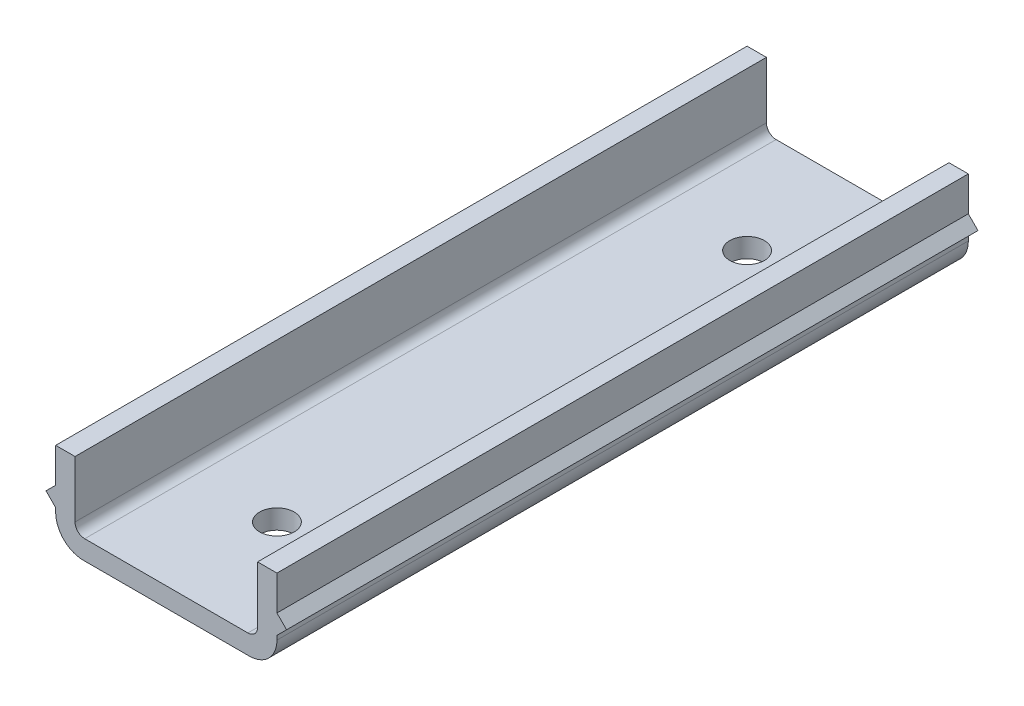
ISO-10303-21;
HEADER;
FILE_DESCRIPTION(('STEP AP214'),'2;1');
FILE_NAME('part.step','',(''),(''),'','','');
FILE_SCHEMA(('AUTOMOTIVE_DESIGN { 1 0 10303 214 1 1 1 1 }'));
ENDSEC;
DATA;
#1=APPLICATION_CONTEXT('core data for automotive mechanical design processes');
#2=APPLICATION_PROTOCOL_DEFINITION('international standard','automotive_design',2000,#1);
#3=PRODUCT_CONTEXT('',#1,'mechanical');
#4=PRODUCT('Part','Part','',(#3));
#5=PRODUCT_RELATED_PRODUCT_CATEGORY('part','',(#4));
#6=PRODUCT_DEFINITION_FORMATION('','',#4);
#7=PRODUCT_DEFINITION_CONTEXT('part definition',#1,'design');
#8=PRODUCT_DEFINITION('design','',#6,#7);
#9=PRODUCT_DEFINITION_SHAPE('','',#8);
#10=(LENGTH_UNIT() NAMED_UNIT(*) SI_UNIT(.MILLI.,.METRE.));
#11=(NAMED_UNIT(*) PLANE_ANGLE_UNIT() SI_UNIT($,.RADIAN.));
#12=(NAMED_UNIT(*) SI_UNIT($,.STERADIAN.) SOLID_ANGLE_UNIT());
#13=UNCERTAINTY_MEASURE_WITH_UNIT(LENGTH_MEASURE(1.E-05),#10,'distance_accuracy_value','');
#14=(GEOMETRIC_REPRESENTATION_CONTEXT(3) GLOBAL_UNCERTAINTY_ASSIGNED_CONTEXT((#13)) GLOBAL_UNIT_ASSIGNED_CONTEXT((#10,
#11,#12)) REPRESENTATION_CONTEXT('',''));
#15=CARTESIAN_POINT('',(0.,0.,0.));
#16=DIRECTION('',(0.,0.,1.));
#17=DIRECTION('',(1.,0.,0.));
#18=AXIS2_PLACEMENT_3D('',#15,#16,#17);
#19=CARTESIAN_POINT('',(8.00000000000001,2.3,50.));
#20=DIRECTION('',(-1.,0.,0.));
#21=DIRECTION('',(0.,-1.,0.));
#22=AXIS2_PLACEMENT_3D('',#19,#20,#21);
#23=PLANE('',#22);
#24=DIRECTION('',(0.,1.,0.));
#25=VECTOR('',#24,1.);
#26=CARTESIAN_POINT('',(8.00000000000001,2.3,50.));
#27=LINE('',#26,#25);
#28=CARTESIAN_POINT('',(8.00000000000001,2.,50.));
#29=VERTEX_POINT('',#28);
#30=CARTESIAN_POINT('',(8.00000000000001,2.3,50.));
#31=VERTEX_POINT('',#30);
#32=EDGE_CURVE('E230',#29,#31,#27,.T.);
#33=ORIENTED_EDGE('',*,*,#32,.F.);
#34=DIRECTION('',(0.,0.,-1.));
#35=VECTOR('',#34,1.);
#36=CARTESIAN_POINT('',(8.00000000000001,2.,50.));
#37=LINE('',#36,#35);
#38=CARTESIAN_POINT('',(8.,2.,0.));
#39=VERTEX_POINT('',#38);
#40=EDGE_CURVE('E262',#29,#39,#37,.T.);
#41=ORIENTED_EDGE('',*,*,#40,.T.);
#42=DIRECTION('',(0.,1.,0.));
#43=VECTOR('',#42,1.);
#44=CARTESIAN_POINT('',(8.,2.3,0.));
#45=LINE('',#44,#43);
#46=CARTESIAN_POINT('',(8.,2.3,0.));
#47=VERTEX_POINT('',#46);
#48=EDGE_CURVE('E168',#39,#47,#45,.T.);
#49=ORIENTED_EDGE('',*,*,#48,.T.);
#50=DIRECTION('',(0.,0.,-1.));
#51=VECTOR('',#50,1.);
#52=CARTESIAN_POINT('',(8.00000000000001,2.3,50.));
#53=LINE('',#52,#51);
#54=EDGE_CURVE('E259',#31,#47,#53,.T.);
#55=ORIENTED_EDGE('',*,*,#54,.F.);
#56=EDGE_LOOP('',(#33,#41,#49,#55));
#57=FACE_BOUND('',#56,.T.);
#58=ADVANCED_FACE('F33',(#57),#23,.F.);
#59=CARTESIAN_POINT('',(8.7,2.99999999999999,50.));
#60=DIRECTION('',(-0.707106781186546,0.70710678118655,0.));
#61=DIRECTION('',(-0.707106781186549,-0.707106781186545,0.));
#62=AXIS2_PLACEMENT_3D('',#59,#60,#61);
#63=PLANE('',#62);
#64=DIRECTION('',(0.707106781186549,0.707106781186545,0.));
#65=VECTOR('',#64,1.);
#66=CARTESIAN_POINT('',(8.7,3.,0.));
#67=LINE('',#66,#65);
#68=CARTESIAN_POINT('',(8.7,3.,0.));
#69=VERTEX_POINT('',#68);
#70=EDGE_CURVE('E215',#47,#69,#67,.T.);
#71=ORIENTED_EDGE('',*,*,#70,.T.);
#72=DIRECTION('',(0.,0.,-1.));
#73=VECTOR('',#72,1.);
#74=CARTESIAN_POINT('',(8.7,2.99999999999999,50.));
#75=LINE('',#74,#73);
#76=CARTESIAN_POINT('',(8.7,2.99999999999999,50.));
#77=VERTEX_POINT('',#76);
#78=EDGE_CURVE('E256',#77,#69,#75,.T.);
#79=ORIENTED_EDGE('',*,*,#78,.F.);
#80=DIRECTION('',(0.707106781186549,0.707106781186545,0.));
#81=VECTOR('',#80,1.);
#82=CARTESIAN_POINT('',(8.7,2.99999999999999,50.));
#83=LINE('',#82,#81);
#84=EDGE_CURVE('E232',#31,#77,#83,.T.);
#85=ORIENTED_EDGE('',*,*,#84,.F.);
#86=ORIENTED_EDGE('',*,*,#54,.T.);
#87=EDGE_LOOP('',(#71,#79,#85,#86));
#88=FACE_BOUND('',#87,.T.);
#89=ADVANCED_FACE('F370',(#88),#63,.F.);
#90=CARTESIAN_POINT('',(8.00000000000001,3.69999999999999,50.));
#91=DIRECTION('',(-0.707106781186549,-0.707106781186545,0.));
#92=DIRECTION('',(0.707106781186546,-0.70710678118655,0.));
#93=AXIS2_PLACEMENT_3D('',#90,#91,#92);
#94=PLANE('',#93);
#95=DIRECTION('',(-0.707106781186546,0.70710678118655,0.));
#96=VECTOR('',#95,1.);
#97=CARTESIAN_POINT('',(8.,3.7,0.));
#98=LINE('',#97,#96);
#99=CARTESIAN_POINT('',(8.,3.7,0.));
#100=VERTEX_POINT('',#99);
#101=EDGE_CURVE('E217',#69,#100,#98,.T.);
#102=ORIENTED_EDGE('',*,*,#101,.T.);
#103=DIRECTION('',(0.,0.,-1.));
#104=VECTOR('',#103,1.);
#105=CARTESIAN_POINT('',(8.00000000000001,3.69999999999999,50.));
#106=LINE('',#105,#104);
#107=CARTESIAN_POINT('',(8.00000000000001,3.69999999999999,50.));
#108=VERTEX_POINT('',#107);
#109=EDGE_CURVE('E253',#108,#100,#106,.T.);
#110=ORIENTED_EDGE('',*,*,#109,.F.);
#111=DIRECTION('',(-0.707106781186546,0.70710678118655,0.));
#112=VECTOR('',#111,1.);
#113=CARTESIAN_POINT('',(8.00000000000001,3.69999999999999,50.));
#114=LINE('',#113,#112);
#115=EDGE_CURVE('E234',#77,#108,#114,.T.);
#116=ORIENTED_EDGE('',*,*,#115,.F.);
#117=ORIENTED_EDGE('',*,*,#78,.T.);
#118=EDGE_LOOP('',(#102,#110,#116,#117));
#119=FACE_BOUND('',#118,.T.);
#120=ADVANCED_FACE('F366',(#119),#94,.F.);
#121=CARTESIAN_POINT('',(8.,6.19999999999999,50.));
#122=DIRECTION('',(-1.,0.,0.));
#123=DIRECTION('',(0.,-1.,0.));
#124=AXIS2_PLACEMENT_3D('',#121,#122,#123);
#125=PLANE('',#124);
#126=DIRECTION('',(0.,1.,0.));
#127=VECTOR('',#126,1.);
#128=CARTESIAN_POINT('',(8.,6.2,0.));
#129=LINE('',#128,#127);
#130=CARTESIAN_POINT('',(8.,6.2,0.));
#131=VERTEX_POINT('',#130);
#132=EDGE_CURVE('E219',#100,#131,#129,.T.);
#133=ORIENTED_EDGE('',*,*,#132,.T.);
#134=DIRECTION('',(0.,0.,-1.));
#135=VECTOR('',#134,1.);
#136=CARTESIAN_POINT('',(8.,6.19999999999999,50.));
#137=LINE('',#136,#135);
#138=CARTESIAN_POINT('',(8.,6.19999999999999,50.));
#139=VERTEX_POINT('',#138);
#140=EDGE_CURVE('E250',#139,#131,#137,.T.);
#141=ORIENTED_EDGE('',*,*,#140,.F.);
#142=DIRECTION('',(0.,1.,0.));
#143=VECTOR('',#142,1.);
#144=CARTESIAN_POINT('',(8.,6.19999999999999,50.));
#145=LINE('',#144,#143);
#146=EDGE_CURVE('E236',#108,#139,#145,.T.);
#147=ORIENTED_EDGE('',*,*,#146,.F.);
#148=ORIENTED_EDGE('',*,*,#109,.T.);
#149=EDGE_LOOP('',(#133,#141,#147,#148));
#150=FACE_BOUND('',#149,.T.);
#151=ADVANCED_FACE('F361',(#150),#125,.F.);
#152=CARTESIAN_POINT('',(6.6,6.19999999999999,50.));
#153=DIRECTION('',(0.,-1.,0.));
#154=DIRECTION('',(1.,0.,0.));
#155=AXIS2_PLACEMENT_3D('',#152,#153,#154);
#156=PLANE('',#155);
#157=DIRECTION('',(-1.,0.,0.));
#158=VECTOR('',#157,1.);
#159=CARTESIAN_POINT('',(6.6,6.2,0.));
#160=LINE('',#159,#158);
#161=CARTESIAN_POINT('',(6.6,6.2,0.));
#162=VERTEX_POINT('',#161);
#163=EDGE_CURVE('E221',#131,#162,#160,.T.);
#164=ORIENTED_EDGE('',*,*,#163,.T.);
#165=DIRECTION('',(0.,0.,-1.));
#166=VECTOR('',#165,1.);
#167=CARTESIAN_POINT('',(6.6,6.19999999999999,50.));
#168=LINE('',#167,#166);
#169=CARTESIAN_POINT('',(6.6,6.19999999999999,50.));
#170=VERTEX_POINT('',#169);
#171=EDGE_CURVE('E247',#170,#162,#168,.T.);
#172=ORIENTED_EDGE('',*,*,#171,.F.);
#173=DIRECTION('',(-1.,0.,0.));
#174=VECTOR('',#173,1.);
#175=CARTESIAN_POINT('',(6.6,6.19999999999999,50.));
#176=LINE('',#175,#174);
#177=EDGE_CURVE('E238',#139,#170,#176,.T.);
#178=ORIENTED_EDGE('',*,*,#177,.F.);
#179=ORIENTED_EDGE('',*,*,#140,.T.);
#180=EDGE_LOOP('',(#164,#172,#178,#179));
#181=FACE_BOUND('',#180,.T.);
#182=ADVANCED_FACE('F355',(#181),#156,.F.);
#183=CARTESIAN_POINT('',(6.6,6.19999999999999,50.));
#184=DIRECTION('',(1.,0.,0.));
#185=DIRECTION('',(0.,1.,0.));
#186=AXIS2_PLACEMENT_3D('',#183,#184,#185);
#187=PLANE('',#186);
#188=DIRECTION('',(0.,-1.,0.));
#189=VECTOR('',#188,1.);
#190=CARTESIAN_POINT('',(6.6,6.2,0.));
#191=LINE('',#190,#189);
#192=CARTESIAN_POINT('',(6.6,2.1,0.));
#193=VERTEX_POINT('',#192);
#194=EDGE_CURVE('E223',#162,#193,#191,.T.);
#195=ORIENTED_EDGE('',*,*,#194,.T.);
#196=DIRECTION('',(0.,0.,-1.));
#197=VECTOR('',#196,1.);
#198=CARTESIAN_POINT('',(6.60000000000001,2.09999999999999,50.));
#199=LINE('',#198,#197);
#200=CARTESIAN_POINT('',(6.60000000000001,2.1,50.));
#201=VERTEX_POINT('',#200);
#202=EDGE_CURVE('E276',#193,#201,#199,.F.);
#203=ORIENTED_EDGE('',*,*,#202,.T.);
#204=DIRECTION('',(0.,-1.,0.));
#205=VECTOR('',#204,1.);
#206=CARTESIAN_POINT('',(6.6,6.19999999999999,50.));
#207=LINE('',#206,#205);
#208=EDGE_CURVE('E240',#170,#201,#207,.T.);
#209=ORIENTED_EDGE('',*,*,#208,.F.);
#210=ORIENTED_EDGE('',*,*,#171,.T.);
#211=EDGE_LOOP('',(#195,#203,#209,#210));
#212=FACE_BOUND('',#211,.T.);
#213=ADVANCED_FACE('F337',(#212),#187,.F.);
#214=CARTESIAN_POINT('',(6.60000000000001,1.39999999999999,50.));
#215=DIRECTION('',(0.,-1.,0.));
#216=DIRECTION('',(1.,0.,0.));
#217=AXIS2_PLACEMENT_3D('',#214,#215,#216);
#218=PLANE('',#217);
#219=CARTESIAN_POINT('',(0.,1.4,42.));
#220=DIRECTION('',(0.,-1.,0.));
#221=DIRECTION('',(1.,0.,0.));
#222=AXIS2_PLACEMENT_3D('',#219,#220,#221);
#223=CIRCLE('',#222,1.24999999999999);
#224=CARTESIAN_POINT('',(1.25,1.4,42.));
#225=VERTEX_POINT('',#224);
#226=EDGE_CURVE('E318',#225,#225,#223,.T.);
#227=ORIENTED_EDGE('',*,*,#226,.T.);
#228=EDGE_LOOP('',(#227));
#229=FACE_BOUND('',#228,.T.);
#230=CARTESIAN_POINT('',(0.,1.4,8.));
#231=DIRECTION('',(0.,-1.,0.));
#232=DIRECTION('',(1.,0.,0.));
#233=AXIS2_PLACEMENT_3D('',#230,#231,#232);
#234=CIRCLE('',#233,1.24999999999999);
#235=CARTESIAN_POINT('',(1.25,1.4,8.));
#236=VERTEX_POINT('',#235);
#237=EDGE_CURVE('E311',#236,#236,#234,.T.);
#238=ORIENTED_EDGE('',*,*,#237,.T.);
#239=EDGE_LOOP('',(#238));
#240=FACE_BOUND('',#239,.T.);
#241=DIRECTION('',(-1.,0.,0.));
#242=VECTOR('',#241,1.);
#243=CARTESIAN_POINT('',(6.6,1.4,0.));
#244=LINE('',#243,#242);
#245=CARTESIAN_POINT('',(5.9,1.4,0.));
#246=VERTEX_POINT('',#245);
#247=CARTESIAN_POINT('',(-5.9,1.4,0.));
#248=VERTEX_POINT('',#247);
#249=EDGE_CURVE('E226',#246,#248,#244,.T.);
#250=ORIENTED_EDGE('',*,*,#249,.T.);
#251=DIRECTION('',(0.,0.,-1.));
#252=VECTOR('',#251,1.);
#253=CARTESIAN_POINT('',(-5.9,1.4,50.));
#254=LINE('',#253,#252);
#255=CARTESIAN_POINT('',(-5.9,1.4,50.));
#256=VERTEX_POINT('',#255);
#257=EDGE_CURVE('E53',#248,#256,#254,.F.);
#258=ORIENTED_EDGE('',*,*,#257,.T.);
#259=DIRECTION('',(-1.,0.,0.));
#260=VECTOR('',#259,1.);
#261=CARTESIAN_POINT('',(6.60000000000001,1.39999999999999,50.));
#262=LINE('',#261,#260);
#263=CARTESIAN_POINT('',(5.90000000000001,1.39999999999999,50.));
#264=VERTEX_POINT('',#263);
#265=EDGE_CURVE('E243',#264,#256,#262,.T.);
#266=ORIENTED_EDGE('',*,*,#265,.F.);
#267=DIRECTION('',(0.,0.,-1.));
#268=VECTOR('',#267,1.);
#269=CARTESIAN_POINT('',(5.9,1.4,0.));
#270=LINE('',#269,#268);
#271=EDGE_CURVE('E273',#264,#246,#270,.T.);
#272=ORIENTED_EDGE('',*,*,#271,.T.);
#273=EDGE_LOOP('',(#250,#258,#266,#272));
#274=FACE_BOUND('',#273,.T.);
#275=ADVANCED_FACE('F334',(#229,#240,#274),#218,.F.);
#276=CARTESIAN_POINT('',(0.,0.,50.));
#277=DIRECTION('',(0.,1.,0.));
#278=DIRECTION('',(0.,0.,1.));
#279=AXIS2_PLACEMENT_3D('',#276,#277,#278);
#280=PLANE('',#279);
#281=CARTESIAN_POINT('',(0.,0.,42.));
#282=DIRECTION('',(0.,1.,0.));
#283=DIRECTION('',(0.,0.,1.));
#284=AXIS2_PLACEMENT_3D('',#281,#282,#283);
#285=CIRCLE('',#284,1.25);
#286=CARTESIAN_POINT('',(0.,0.,43.25));
#287=VERTEX_POINT('',#286);
#288=EDGE_CURVE('E321',#287,#287,#285,.T.);
#289=ORIENTED_EDGE('',*,*,#288,.T.);
#290=EDGE_LOOP('',(#289));
#291=FACE_BOUND('',#290,.T.);
#292=CARTESIAN_POINT('',(0.,0.,8.));
#293=DIRECTION('',(0.,1.,0.));
#294=DIRECTION('',(0.,0.,1.));
#295=AXIS2_PLACEMENT_3D('',#292,#293,#294);
#296=CIRCLE('',#295,1.25);
#297=CARTESIAN_POINT('',(0.,0.,9.25));
#298=VERTEX_POINT('',#297);
#299=EDGE_CURVE('E313',#298,#298,#296,.T.);
#300=ORIENTED_EDGE('',*,*,#299,.T.);
#301=EDGE_LOOP('',(#300));
#302=FACE_BOUND('',#301,.T.);
#303=DIRECTION('',(1.,0.,0.));
#304=VECTOR('',#303,1.);
#305=CARTESIAN_POINT('',(0.,0.,50.));
#306=LINE('',#305,#304);
#307=CARTESIAN_POINT('',(-6.,0.,50.));
#308=VERTEX_POINT('',#307);
#309=CARTESIAN_POINT('',(6.00000000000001,0.,50.));
#310=VERTEX_POINT('',#309);
#311=EDGE_CURVE('E245',#308,#310,#306,.T.);
#312=ORIENTED_EDGE('',*,*,#311,.F.);
#313=DIRECTION('',(0.,0.,-1.));
#314=VECTOR('',#313,1.);
#315=CARTESIAN_POINT('',(-6.,0.,0.));
#316=LINE('',#315,#314);
#317=CARTESIAN_POINT('',(-6.,0.,0.));
#318=VERTEX_POINT('',#317);
#319=EDGE_CURVE('E282',#308,#318,#316,.T.);
#320=ORIENTED_EDGE('',*,*,#319,.T.);
#321=DIRECTION('',(1.,0.,0.));
#322=VECTOR('',#321,1.);
#323=CARTESIAN_POINT('',(0.,0.,0.));
#324=LINE('',#323,#322);
#325=CARTESIAN_POINT('',(6.,0.,0.));
#326=VERTEX_POINT('',#325);
#327=EDGE_CURVE('E228',#318,#326,#324,.T.);
#328=ORIENTED_EDGE('',*,*,#327,.T.);
#329=DIRECTION('',(0.,0.,-1.));
#330=VECTOR('',#329,1.);
#331=CARTESIAN_POINT('',(6.00000000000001,0.,50.));
#332=LINE('',#331,#330);
#333=EDGE_CURVE('E268',#326,#310,#332,.F.);
#334=ORIENTED_EDGE('',*,*,#333,.T.);
#335=EDGE_LOOP('',(#312,#320,#328,#334));
#336=FACE_BOUND('',#335,.T.);
#337=ADVANCED_FACE('F302',(#291,#302,#336),#280,.F.);
#338=CARTESIAN_POINT('',(8.00000000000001,1.39999999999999,50.));
#339=DIRECTION('',(0.,0.,-1.));
#340=DIRECTION('',(-1.,0.,0.));
#341=AXIS2_PLACEMENT_3D('',#338,#339,#340);
#342=PLANE('',#341);
#343=DIRECTION('',(0.,1.,0.));
#344=VECTOR('',#343,1.);
#345=CARTESIAN_POINT('',(-8.,2.3,50.));
#346=LINE('',#345,#344);
#347=CARTESIAN_POINT('',(-8.,2.,50.));
#348=VERTEX_POINT('',#347);
#349=CARTESIAN_POINT('',(-8.,2.3,50.));
#350=VERTEX_POINT('',#349);
#351=EDGE_CURVE('E192',#348,#350,#346,.T.);
#352=ORIENTED_EDGE('',*,*,#351,.F.);
#353=CARTESIAN_POINT('',(-6.,2.,50.));
#354=DIRECTION('',(0.,0.,-1.));
#355=DIRECTION('',(-1.,0.,0.));
#356=AXIS2_PLACEMENT_3D('',#353,#354,#355);
#357=CIRCLE('',#356,2.);
#358=EDGE_CURVE('E289',#348,#308,#357,.F.);
#359=ORIENTED_EDGE('',*,*,#358,.T.);
#360=ORIENTED_EDGE('',*,*,#311,.T.);
#361=CARTESIAN_POINT('',(6.00000000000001,1.99999999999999,50.));
#362=DIRECTION('',(0.,0.,-1.));
#363=DIRECTION('',(-1.,0.,0.));
#364=AXIS2_PLACEMENT_3D('',#361,#362,#363);
#365=CIRCLE('',#364,2.);
#366=EDGE_CURVE('E271',#310,#29,#365,.F.);
#367=ORIENTED_EDGE('',*,*,#366,.T.);
#368=ORIENTED_EDGE('',*,*,#32,.T.);
#369=ORIENTED_EDGE('',*,*,#84,.T.);
#370=ORIENTED_EDGE('',*,*,#115,.T.);
#371=ORIENTED_EDGE('',*,*,#146,.T.);
#372=ORIENTED_EDGE('',*,*,#177,.T.);
#373=ORIENTED_EDGE('',*,*,#208,.T.);
#374=CARTESIAN_POINT('',(5.90000000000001,2.09999999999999,50.));
#375=DIRECTION('',(0.,0.,-1.));
#376=DIRECTION('',(-1.,0.,0.));
#377=AXIS2_PLACEMENT_3D('',#374,#375,#376);
#378=CIRCLE('',#377,0.7);
#379=EDGE_CURVE('E280',#201,#264,#378,.T.);
#380=ORIENTED_EDGE('',*,*,#379,.T.);
#381=ORIENTED_EDGE('',*,*,#265,.T.);
#382=CARTESIAN_POINT('',(-5.9,2.1,50.));
#383=DIRECTION('',(0.,0.,-1.));
#384=DIRECTION('',(-1.,0.,0.));
#385=AXIS2_PLACEMENT_3D('',#382,#383,#384);
#386=CIRCLE('',#385,0.7);
#387=CARTESIAN_POINT('',(-6.6,2.1,50.));
#388=VERTEX_POINT('',#387);
#389=EDGE_CURVE('E11',#256,#388,#386,.T.);
#390=ORIENTED_EDGE('',*,*,#389,.T.);
#391=DIRECTION('',(0.,-1.,0.));
#392=VECTOR('',#391,1.);
#393=CARTESIAN_POINT('',(-6.6,6.2,50.));
#394=LINE('',#393,#392);
#395=CARTESIAN_POINT('',(-6.6,6.2,50.));
#396=VERTEX_POINT('',#395);
#397=EDGE_CURVE('E194',#396,#388,#394,.T.);
#398=ORIENTED_EDGE('',*,*,#397,.F.);
#399=DIRECTION('',(1.,0.,0.));
#400=VECTOR('',#399,1.);
#401=CARTESIAN_POINT('',(-6.6,6.2,50.));
#402=LINE('',#401,#400);
#403=CARTESIAN_POINT('',(-8.,6.2,50.));
#404=VERTEX_POINT('',#403);
#405=EDGE_CURVE('E164',#404,#396,#402,.T.);
#406=ORIENTED_EDGE('',*,*,#405,.F.);
#407=DIRECTION('',(0.,1.,0.));
#408=VECTOR('',#407,1.);
#409=CARTESIAN_POINT('',(-8.,6.2,50.));
#410=LINE('',#409,#408);
#411=CARTESIAN_POINT('',(-8.,3.7,50.));
#412=VERTEX_POINT('',#411);
#413=EDGE_CURVE('E197',#412,#404,#410,.T.);
#414=ORIENTED_EDGE('',*,*,#413,.F.);
#415=DIRECTION('',(0.707106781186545,0.707106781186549,0.));
#416=VECTOR('',#415,1.);
#417=CARTESIAN_POINT('',(-8.,3.7,50.));
#418=LINE('',#417,#416);
#419=CARTESIAN_POINT('',(-8.7,3.,50.));
#420=VERTEX_POINT('',#419);
#421=EDGE_CURVE('E200',#420,#412,#418,.T.);
#422=ORIENTED_EDGE('',*,*,#421,.F.);
#423=DIRECTION('',(-0.70710678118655,0.707106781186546,0.));
#424=VECTOR('',#423,1.);
#425=CARTESIAN_POINT('',(-8.7,3.,50.));
#426=LINE('',#425,#424);
#427=EDGE_CURVE('E203',#350,#420,#426,.T.);
#428=ORIENTED_EDGE('',*,*,#427,.F.);
#429=EDGE_LOOP('',(#352,#359,#360,#367,#368,#369,#370,#371,#372,#373,#380,#381,#390,#398,#406,
#414,#422,#428));
#430=FACE_BOUND('',#429,.T.);
#431=ADVANCED_FACE('F296',(#430),#342,.F.);
#432=CARTESIAN_POINT('',(8.,1.4,0.));
#433=DIRECTION('',(0.,0.,-1.));
#434=DIRECTION('',(-1.,0.,0.));
#435=AXIS2_PLACEMENT_3D('',#432,#433,#434);
#436=PLANE('',#435);
#437=ORIENTED_EDGE('',*,*,#327,.F.);
#438=CARTESIAN_POINT('',(-6.,2.,0.));
#439=DIRECTION('',(0.,0.,-1.));
#440=DIRECTION('',(-1.,0.,0.));
#441=AXIS2_PLACEMENT_3D('',#438,#439,#440);
#442=CIRCLE('',#441,2.);
#443=CARTESIAN_POINT('',(-8.00000000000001,2.,0.));
#444=VERTEX_POINT('',#443);
#445=EDGE_CURVE('E285',#318,#444,#442,.T.);
#446=ORIENTED_EDGE('',*,*,#445,.T.);
#447=DIRECTION('',(0.,1.,0.));
#448=VECTOR('',#447,1.);
#449=CARTESIAN_POINT('',(-8.00000000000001,2.3,0.));
#450=LINE('',#449,#448);
#451=CARTESIAN_POINT('',(-8.00000000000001,2.3,0.));
#452=VERTEX_POINT('',#451);
#453=EDGE_CURVE('E176',#444,#452,#450,.T.);
#454=ORIENTED_EDGE('',*,*,#453,.T.);
#455=DIRECTION('',(-0.70710678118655,0.707106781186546,0.));
#456=VECTOR('',#455,1.);
#457=CARTESIAN_POINT('',(-8.7,3.,0.));
#458=LINE('',#457,#456);
#459=CARTESIAN_POINT('',(-8.7,3.,0.));
#460=VERTEX_POINT('',#459);
#461=EDGE_CURVE('E189',#452,#460,#458,.T.);
#462=ORIENTED_EDGE('',*,*,#461,.T.);
#463=DIRECTION('',(0.707106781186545,0.707106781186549,0.));
#464=VECTOR('',#463,1.);
#465=CARTESIAN_POINT('',(-8.00000000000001,3.7,0.));
#466=LINE('',#465,#464);
#467=CARTESIAN_POINT('',(-8.00000000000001,3.7,0.));
#468=VERTEX_POINT('',#467);
#469=EDGE_CURVE('E184',#460,#468,#466,.T.);
#470=ORIENTED_EDGE('',*,*,#469,.T.);
#471=DIRECTION('',(0.,1.,0.));
#472=VECTOR('',#471,1.);
#473=CARTESIAN_POINT('',(-8.,6.2,0.));
#474=LINE('',#473,#472);
#475=CARTESIAN_POINT('',(-8.,6.2,0.));
#476=VERTEX_POINT('',#475);
#477=EDGE_CURVE('E182',#468,#476,#474,.T.);
#478=ORIENTED_EDGE('',*,*,#477,.T.);
#479=DIRECTION('',(1.,0.,0.));
#480=VECTOR('',#479,1.);
#481=CARTESIAN_POINT('',(-6.6,6.2,0.));
#482=LINE('',#481,#480);
#483=CARTESIAN_POINT('',(-6.6,6.2,0.));
#484=VERTEX_POINT('',#483);
#485=EDGE_CURVE('E161',#476,#484,#482,.T.);
#486=ORIENTED_EDGE('',*,*,#485,.T.);
#487=DIRECTION('',(0.,-1.,0.));
#488=VECTOR('',#487,1.);
#489=CARTESIAN_POINT('',(-6.6,6.2,0.));
#490=LINE('',#489,#488);
#491=CARTESIAN_POINT('',(-6.6,2.1,0.));
#492=VERTEX_POINT('',#491);
#493=EDGE_CURVE('E172',#484,#492,#490,.T.);
#494=ORIENTED_EDGE('',*,*,#493,.T.);
#495=CARTESIAN_POINT('',(-5.9,2.1,0.));
#496=DIRECTION('',(0.,0.,-1.));
#497=DIRECTION('',(-1.,0.,0.));
#498=AXIS2_PLACEMENT_3D('',#495,#496,#497);
#499=CIRCLE('',#498,0.7);
#500=EDGE_CURVE('E40',#492,#248,#499,.F.);
#501=ORIENTED_EDGE('',*,*,#500,.T.);
#502=ORIENTED_EDGE('',*,*,#249,.F.);
#503=CARTESIAN_POINT('',(5.9,2.1,0.));
#504=DIRECTION('',(0.,0.,-1.));
#505=DIRECTION('',(-1.,0.,0.));
#506=AXIS2_PLACEMENT_3D('',#503,#504,#505);
#507=CIRCLE('',#506,0.7);
#508=EDGE_CURVE('E278',#246,#193,#507,.F.);
#509=ORIENTED_EDGE('',*,*,#508,.T.);
#510=ORIENTED_EDGE('',*,*,#194,.F.);
#511=ORIENTED_EDGE('',*,*,#163,.F.);
#512=ORIENTED_EDGE('',*,*,#132,.F.);
#513=ORIENTED_EDGE('',*,*,#101,.F.);
#514=ORIENTED_EDGE('',*,*,#70,.F.);
#515=ORIENTED_EDGE('',*,*,#48,.F.);
#516=CARTESIAN_POINT('',(6.,2.,0.));
#517=DIRECTION('',(0.,0.,-1.));
#518=DIRECTION('',(-1.,0.,0.));
#519=AXIS2_PLACEMENT_3D('',#516,#517,#518);
#520=CIRCLE('',#519,2.);
#521=EDGE_CURVE('E265',#39,#326,#520,.T.);
#522=ORIENTED_EDGE('',*,*,#521,.T.);
#523=EDGE_LOOP('',(#437,#446,#454,#462,#470,#478,#486,#494,#501,#502,#509,#510,#511,#512,#513,
#514,#515,#522));
#524=FACE_BOUND('',#523,.T.);
#525=ADVANCED_FACE('F179',(#524),#436,.T.);
#526=CARTESIAN_POINT('',(6.00000000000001,1.99999999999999,50.));
#527=DIRECTION('',(0.,0.,-1.));
#528=DIRECTION('',(-1.,0.,0.));
#529=AXIS2_PLACEMENT_3D('',#526,#527,#528);
#530=CYLINDRICAL_SURFACE('',#529,2.);
#531=ORIENTED_EDGE('',*,*,#366,.F.);
#532=ORIENTED_EDGE('',*,*,#333,.F.);
#533=ORIENTED_EDGE('',*,*,#521,.F.);
#534=ORIENTED_EDGE('',*,*,#40,.F.);
#535=EDGE_LOOP('',(#531,#532,#533,#534));
#536=FACE_BOUND('',#535,.T.);
#537=ADVANCED_FACE('F377',(#536),#530,.T.);
#538=CARTESIAN_POINT('',(5.90000000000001,2.09999999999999,50.));
#539=DIRECTION('',(0.,0.,1.));
#540=DIRECTION('',(1.,0.,0.));
#541=AXIS2_PLACEMENT_3D('',#538,#539,#540);
#542=CYLINDRICAL_SURFACE('',#541,0.7);
#543=ORIENTED_EDGE('',*,*,#379,.F.);
#544=ORIENTED_EDGE('',*,*,#202,.F.);
#545=ORIENTED_EDGE('',*,*,#508,.F.);
#546=ORIENTED_EDGE('',*,*,#271,.F.);
#547=EDGE_LOOP('',(#543,#544,#545,#546));
#548=FACE_BOUND('',#547,.T.);
#549=ADVANCED_FACE('F346',(#548),#542,.F.);
#550=CARTESIAN_POINT('',(-8.,2.3,50.));
#551=DIRECTION('',(-1.,0.,0.));
#552=DIRECTION('',(0.,-1.,0.));
#553=AXIS2_PLACEMENT_3D('',#550,#551,#552);
#554=PLANE('',#553);
#555=ORIENTED_EDGE('',*,*,#453,.F.);
#556=DIRECTION('',(0.,0.,-1.));
#557=VECTOR('',#556,1.);
#558=CARTESIAN_POINT('',(-8.,2.,50.));
#559=LINE('',#558,#557);
#560=EDGE_CURVE('E287',#444,#348,#559,.F.);
#561=ORIENTED_EDGE('',*,*,#560,.T.);
#562=ORIENTED_EDGE('',*,*,#351,.T.);
#563=DIRECTION('',(0.,0.,-1.));
#564=VECTOR('',#563,1.);
#565=CARTESIAN_POINT('',(-8.,2.3,50.));
#566=LINE('',#565,#564);
#567=EDGE_CURVE('E206',#350,#452,#566,.T.);
#568=ORIENTED_EDGE('',*,*,#567,.T.);
#569=EDGE_LOOP('',(#555,#561,#562,#568));
#570=FACE_BOUND('',#569,.T.);
#571=ADVANCED_FACE('F308',(#570),#554,.T.);
#572=CARTESIAN_POINT('',(-6.6,6.2,50.));
#573=DIRECTION('',(1.,0.,0.));
#574=DIRECTION('',(0.,1.,0.));
#575=AXIS2_PLACEMENT_3D('',#572,#573,#574);
#576=PLANE('',#575);
#577=ORIENTED_EDGE('',*,*,#397,.T.);
#578=DIRECTION('',(0.,0.,-1.));
#579=VECTOR('',#578,1.);
#580=CARTESIAN_POINT('',(-6.6,2.1,50.));
#581=LINE('',#580,#579);
#582=EDGE_CURVE('E175',#388,#492,#581,.T.);
#583=ORIENTED_EDGE('',*,*,#582,.T.);
#584=ORIENTED_EDGE('',*,*,#493,.F.);
#585=DIRECTION('',(0.,0.,-1.));
#586=VECTOR('',#585,1.);
#587=CARTESIAN_POINT('',(-6.6,6.2,50.));
#588=LINE('',#587,#586);
#589=EDGE_CURVE('E157',#396,#484,#588,.T.);
#590=ORIENTED_EDGE('',*,*,#589,.F.);
#591=EDGE_LOOP('',(#577,#583,#584,#590));
#592=FACE_BOUND('',#591,.T.);
#593=ADVANCED_FACE('F173',(#592),#576,.T.);
#594=CARTESIAN_POINT('',(-6.6,6.2,50.));
#595=DIRECTION('',(0.,1.,0.));
#596=DIRECTION('',(-1.,0.,0.));
#597=AXIS2_PLACEMENT_3D('',#594,#595,#596);
#598=PLANE('',#597);
#599=ORIENTED_EDGE('',*,*,#485,.F.);
#600=DIRECTION('',(0.,0.,-1.));
#601=VECTOR('',#600,1.);
#602=CARTESIAN_POINT('',(-8.,6.2,50.));
#603=LINE('',#602,#601);
#604=EDGE_CURVE('E169',#404,#476,#603,.T.);
#605=ORIENTED_EDGE('',*,*,#604,.F.);
#606=ORIENTED_EDGE('',*,*,#405,.T.);
#607=ORIENTED_EDGE('',*,*,#589,.T.);
#608=EDGE_LOOP('',(#599,#605,#606,#607));
#609=FACE_BOUND('',#608,.T.);
#610=ADVANCED_FACE('F159',(#609),#598,.T.);
#611=CARTESIAN_POINT('',(-8.,6.2,50.));
#612=DIRECTION('',(-1.,0.,0.));
#613=DIRECTION('',(0.,-1.,0.));
#614=AXIS2_PLACEMENT_3D('',#611,#612,#613);
#615=PLANE('',#614);
#616=ORIENTED_EDGE('',*,*,#477,.F.);
#617=DIRECTION('',(0.,0.,-1.));
#618=VECTOR('',#617,1.);
#619=CARTESIAN_POINT('',(-8.,3.7,50.));
#620=LINE('',#619,#618);
#621=EDGE_CURVE('E211',#412,#468,#620,.T.);
#622=ORIENTED_EDGE('',*,*,#621,.F.);
#623=ORIENTED_EDGE('',*,*,#413,.T.);
#624=ORIENTED_EDGE('',*,*,#604,.T.);
#625=EDGE_LOOP('',(#616,#622,#623,#624));
#626=FACE_BOUND('',#625,.T.);
#627=ADVANCED_FACE('F449',(#626),#615,.T.);
#628=CARTESIAN_POINT('',(-8.,3.7,50.));
#629=DIRECTION('',(-0.70710678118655,0.707106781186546,0.));
#630=DIRECTION('',(-0.707106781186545,-0.707106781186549,0.));
#631=AXIS2_PLACEMENT_3D('',#628,#629,#630);
#632=PLANE('',#631);
#633=ORIENTED_EDGE('',*,*,#469,.F.);
#634=DIRECTION('',(0.,0.,-1.));
#635=VECTOR('',#634,1.);
#636=CARTESIAN_POINT('',(-8.7,3.,50.));
#637=LINE('',#636,#635);
#638=EDGE_CURVE('E209',#420,#460,#637,.T.);
#639=ORIENTED_EDGE('',*,*,#638,.F.);
#640=ORIENTED_EDGE('',*,*,#421,.T.);
#641=ORIENTED_EDGE('',*,*,#621,.T.);
#642=EDGE_LOOP('',(#633,#639,#640,#641));
#643=FACE_BOUND('',#642,.T.);
#644=ADVANCED_FACE('F458',(#643),#632,.T.);
#645=CARTESIAN_POINT('',(-8.7,3.,50.));
#646=DIRECTION('',(-0.707106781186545,-0.707106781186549,0.));
#647=DIRECTION('',(0.70710678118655,-0.707106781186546,0.));
#648=AXIS2_PLACEMENT_3D('',#645,#646,#647);
#649=PLANE('',#648);
#650=ORIENTED_EDGE('',*,*,#461,.F.);
#651=ORIENTED_EDGE('',*,*,#567,.F.);
#652=ORIENTED_EDGE('',*,*,#427,.T.);
#653=ORIENTED_EDGE('',*,*,#638,.T.);
#654=EDGE_LOOP('',(#650,#651,#652,#653));
#655=FACE_BOUND('',#654,.T.);
#656=ADVANCED_FACE('F468',(#655),#649,.T.);
#657=CARTESIAN_POINT('',(-6.,2.,50.));
#658=DIRECTION('',(0.,0.,1.));
#659=DIRECTION('',(1.,0.,0.));
#660=AXIS2_PLACEMENT_3D('',#657,#658,#659);
#661=CYLINDRICAL_SURFACE('',#660,2.);
#662=ORIENTED_EDGE('',*,*,#358,.F.);
#663=ORIENTED_EDGE('',*,*,#560,.F.);
#664=ORIENTED_EDGE('',*,*,#445,.F.);
#665=ORIENTED_EDGE('',*,*,#319,.F.);
#666=EDGE_LOOP('',(#662,#663,#664,#665));
#667=FACE_BOUND('',#666,.T.);
#668=ADVANCED_FACE('F305',(#667),#661,.T.);
#669=CARTESIAN_POINT('',(-5.9,2.1,50.));
#670=DIRECTION('',(0.,0.,-1.));
#671=DIRECTION('',(-1.,0.,0.));
#672=AXIS2_PLACEMENT_3D('',#669,#670,#671);
#673=CYLINDRICAL_SURFACE('',#672,0.7);
#674=ORIENTED_EDGE('',*,*,#389,.F.);
#675=ORIENTED_EDGE('',*,*,#257,.F.);
#676=ORIENTED_EDGE('',*,*,#500,.F.);
#677=ORIENTED_EDGE('',*,*,#582,.F.);
#678=EDGE_LOOP('',(#674,#675,#676,#677));
#679=FACE_BOUND('',#678,.T.);
#680=ADVANCED_FACE('F343',(#679),#673,.F.);
#681=CARTESIAN_POINT('',(0.,6.2,8.));
#682=DIRECTION('',(0.,1.,0.));
#683=DIRECTION('',(0.,0.,1.));
#684=AXIS2_PLACEMENT_3D('',#681,#682,#683);
#685=CYLINDRICAL_SURFACE('',#684,1.24999999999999);
#686=ORIENTED_EDGE('',*,*,#299,.F.);
#687=EDGE_LOOP('',(#686));
#688=FACE_BOUND('',#687,.T.);
#689=ORIENTED_EDGE('',*,*,#237,.F.);
#690=EDGE_LOOP('',(#689));
#691=FACE_BOUND('',#690,.T.);
#692=ADVANCED_FACE('F330',(#688,#691),#685,.F.);
#693=CARTESIAN_POINT('',(0.,6.2,42.));
#694=DIRECTION('',(0.,1.,0.));
#695=DIRECTION('',(0.,0.,1.));
#696=AXIS2_PLACEMENT_3D('',#693,#694,#695);
#697=CYLINDRICAL_SURFACE('',#696,1.24999999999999);
#698=ORIENTED_EDGE('',*,*,#288,.F.);
#699=EDGE_LOOP('',(#698));
#700=FACE_BOUND('',#699,.T.);
#701=ORIENTED_EDGE('',*,*,#226,.F.);
#702=EDGE_LOOP('',(#701));
#703=FACE_BOUND('',#702,.T.);
#704=ADVANCED_FACE('F327',(#700,#703),#697,.F.);
#705=CLOSED_SHELL('',(#58,#89,#120,#151,#182,#213,#275,#337,#431,#525,#537,#549,#571,#593,#610,
#627,#644,#656,#668,#680,#692,#704));
#706=MANIFOLD_SOLID_BREP('B2',#705);
#707=ADVANCED_BREP_SHAPE_REPRESENTATION('',(#18,#706),#14);
#708=SHAPE_DEFINITION_REPRESENTATION(#9,#707);
ENDSEC;
END-ISO-10303-21;
